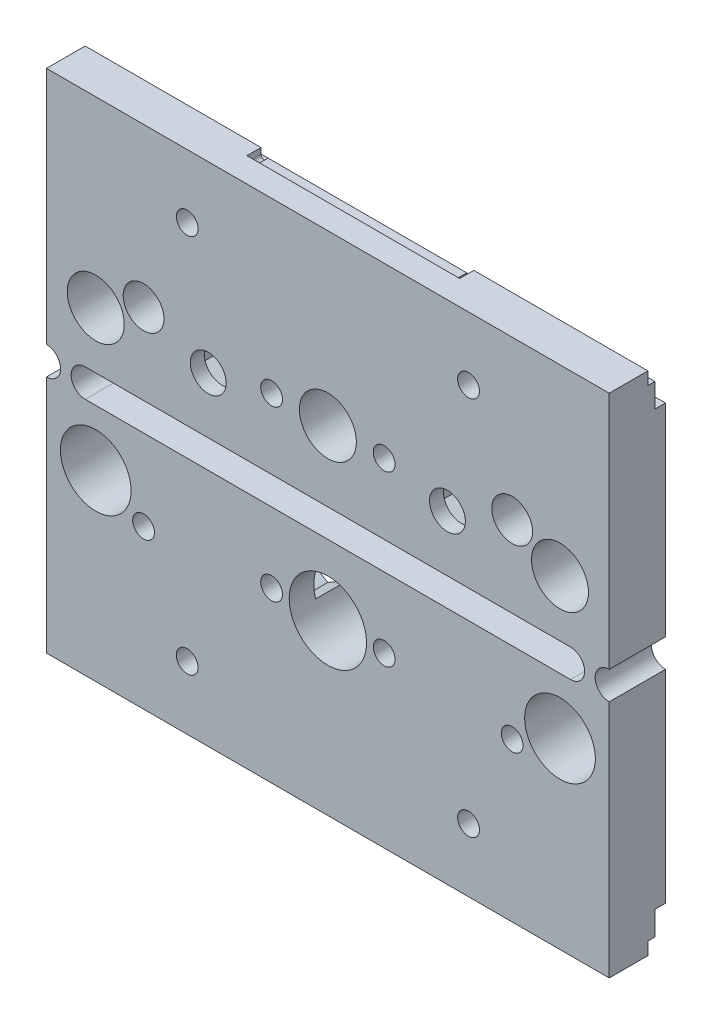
from build123d import *

# Parameters (mm, degrees)
SKETCH_2_W           = 80
SKETCH_2_H           = 34
SKETCH_2_R           = 4.05
EXTRUDE_1_DEPTH      = 8
SKETCH_3_R           = 2.55
CUT_EXTRUDE_1_DEPTH  = 88.292611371
CUT_EXTRUDE_2_DEPTH  = 88.292611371
SKETCH_5_R           = 1.55
CUT_EXTRUDE_3_DEPTH  = 88.292611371
CUT_EXTRUDE_5_DEPTH  = 4.5
SKETCH_25_R          = 1.55
CUT_EXTRUDE_13_DEPTH = 88.292611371
CUT_EXTRUDE_11_DEPTH = 2
EXTRUDE_2_DEPTH      = 8
SKETCH_26_R          = 5.025
CUT_EXTRUDE_14_DEPTH = 89.926936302
SKETCH_27_R          = 2.9
SKETCH_27_R_2        = 1.55
CUT_EXTRUDE_15_DEPTH = 89.926936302
CUT_EXTRUDE_16_DEPTH = 6
SKETCH_29_R          = 5.5
CUT_EXTRUDE_17_DEPTH = 89.926936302


with BuildPart() as part:
    # Sketch 2 → Extrude 1 (new body)
    with BuildSketch(Plane.XY):
        with Locations((40, 17)):
            Rectangle(SKETCH_2_W, SKETCH_2_H)
        with Locations((7, 8)):
            Circle(SKETCH_2_R, mode=Mode.SUBTRACT)
        with Locations((40, 10)):
            Circle(SKETCH_2_R, mode=Mode.SUBTRACT)
        with Locations((73, 8)):
            Circle(SKETCH_2_R, mode=Mode.SUBTRACT)
    extrude_1 = extrude(amount=EXTRUDE_1_DEPTH)

    # Sketch 3 → Cut-Extrude 1 (cut, through all)
    with BuildSketch(Plane.XY.offset(8)):
        with Locations((23, 8)):
            Circle(SKETCH_3_R)
        with Locations((57, 8)):
            Circle(SKETCH_3_R)
    extrude(amount=-CUT_EXTRUDE_1_DEPTH, mode=Mode.SUBTRACT)

    # Sketch 4 → Cut-Extrude 2 (cut, through all)
    with BuildSketch(Plane(origin=(80, 0, 0), x_dir=(0, 0, -1), z_dir=(1, 0, 0))):
        Polygon((-1.5, 32.2), (-2.5, 32.2), (-2.5, 34), (0, 34), (0, 28.8), (-1.5, 28.8), align=None)
    cut_extrude_2 = extrude(amount=-CUT_EXTRUDE_2_DEPTH, mode=Mode.SUBTRACT)

    # Sketch 5 → Cut-Extrude 3 (cut, through all)
    with BuildSketch(Plane.XY.offset(8)):
        with Locations((48, 10)):
            Circle(SKETCH_5_R)
        with Locations((32, 10)):
            Circle(SKETCH_5_R)
    cut_extrude_3 = extrude(amount=-CUT_EXTRUDE_3_DEPTH, mode=Mode.SUBTRACT)

    # Sketch 8 → Cut-Extrude 5 (cut)
    with BuildSketch(Plane(origin=(0, 0, 0), x_dir=(-1, 0, 0), z_dir=(0, 0, -1))):
        Polygon((-45.15, 8.354551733), (-45.15, 11.645448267), (-48, 13.290896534), (-50.85, 11.645448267), (-50.85, 8.354551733), (-48, 6.709103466), align=None)
        Polygon((-29.15, 8.354551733), (-29.15, 11.645448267), (-32, 13.290896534), (-34.85, 11.645448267), (-34.85, 8.354551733), (-32, 6.709103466), align=None)
    cut_extrude_5 = extrude(amount=-CUT_EXTRUDE_5_DEPTH, mode=Mode.SUBTRACT)

    # Sketch 25 → Cut-Extrude 13 (cut, through all)
    with BuildSketch(Plane(origin=(0, 0, 0), x_dir=(-1, 0, 0), z_dir=(0, 0, -1))):
        with Locations((-60, 25)):
            Circle(SKETCH_25_R)
        with Locations((-20, 25)):
            Circle(SKETCH_25_R)
    cut_extrude_13 = extrude(amount=-CUT_EXTRUDE_13_DEPTH, mode=Mode.SUBTRACT)

    # Sketch 19 → Cut-Extrude 11 (cut)
    with BuildSketch(Plane(origin=(0, 0, 2.5), x_dir=(-1, 0, 0), z_dir=(0, 0, -1))):
        with BuildLine():
            Line((-25, 34), (-55.247938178, 34))
            Line((-55.247938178, 34), (-55.247938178, 33.2))
            ThreePointArc((-55.247938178, 33.2), (-54.747938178, 32.7), (-54.247938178, 33.2))
            Line((-54.247938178, 33.2), (-26, 33.2))
            ThreePointArc((-26, 33.2), (-25.5, 32.7), (-25, 33.2))
            Line((-25, 33.2), (-25, 34))
        make_face()
    cut_extrude_11 = extrude(amount=-CUT_EXTRUDE_11_DEPTH, mode=Mode.SUBTRACT)

    # Sketch 22 → Extrude 2 (add)
    with BuildSketch(Plane.XY.offset(8)):
        with BuildLine():
            Line((0, -4), (5.5, -4))
            ThreePointArc((5.5, -4), (3.5, -2), (5.5, 0))
            Line((5.5, 0), (0, 0))
            ThreePointArc((0, 0), (2, -2), (0, -4))
        make_face()
        with BuildLine():
            Line((80, 0), (74.5, 0))
            ThreePointArc((74.5, 0), (76.5, -2), (74.5, -4))
            Line((74.5, -4), (80, -4))
            ThreePointArc((80, -4), (78, -2), (80, 0))
        make_face()
    extrude(amount=-EXTRUDE_2_DEPTH)

    # Mirror 2: Extrude 1, Cut-Extrude 2, Cut-Extrude 3, Cut-Extrude 5, Cut-Extrude 13, Cut-Extrude 11 across plane
    add(extrude_1.mirror(Plane(origin=(0, -2, 0), x_dir=(0, 0, 1), z_dir=(0, -1, 0))))
    add(cut_extrude_2.mirror(Plane(origin=(0, -2, 0), x_dir=(0, 0, 1), z_dir=(0, -1, 0))), mode=Mode.SUBTRACT)
    add(cut_extrude_3.mirror(Plane(origin=(0, -2, 0), x_dir=(0, 0, 1), z_dir=(0, -1, 0))), mode=Mode.SUBTRACT)
    add(cut_extrude_5.mirror(Plane(origin=(0, -2, 0), x_dir=(0, 0, 1), z_dir=(0, -1, 0))), mode=Mode.SUBTRACT)
    add(cut_extrude_13.mirror(Plane(origin=(0, -2, 0), x_dir=(0, 0, 1), z_dir=(0, -1, 0))), mode=Mode.SUBTRACT)
    add(cut_extrude_11.mirror(Plane(origin=(0, -2, 0), x_dir=(0, 0, 1), z_dir=(0, -1, 0))), mode=Mode.SUBTRACT)

    # Sketch 26 → Cut-Extrude 14 (cut, through all)
    with BuildSketch(Plane(origin=(0, 0, 0), x_dir=(-1, 0, 0), z_dir=(0, 0, -1))):
        with Locations((-73, -12)):
            Circle(SKETCH_26_R)
        with Locations((-7, -12)):
            Circle(SKETCH_26_R)
    extrude(amount=-CUT_EXTRUDE_14_DEPTH, mode=Mode.SUBTRACT)

    # Sketch 27 → Cut-Extrude 15 (cut, through all)
    with BuildSketch(Plane(origin=(0, 0, 0), x_dir=(-1, 0, 0), z_dir=(0, 0, -1))):
        with Locations((-66.2, 11.5)):
            Circle(SKETCH_27_R)
        with Locations((-66.2, -15.5)):
            Circle(SKETCH_27_R_2)
        with Locations(Location((-13.8, -15.5, 0), (0, 0, 180))):
            Circle(SKETCH_27_R_2)
        with Locations(Location((-13.8, 11.5, 0), (0, 0, 180))):
            Circle(SKETCH_27_R)
    extrude(amount=-CUT_EXTRUDE_15_DEPTH, mode=Mode.SUBTRACT)

    # Sketch 28 → Cut-Extrude 16 (cut)
    with BuildSketch(Plane(origin=(0, 0, 0), x_dir=(-1, 0, 0), z_dir=(0, 0, -1))):
        Polygon((-52.9, 5.632863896), (-52.9, 10.367136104), (-57, 12.734272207), (-61.1, 10.367136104), (-61.1, 5.632863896), (-57, 3.265727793), align=None)
        Polygon((-18.9, 5.632863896), (-18.9, 10.367136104), (-23, 12.734272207), (-27.1, 10.367136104), (-27.1, 5.632863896), (-23, 3.265727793), align=None)
    extrude(amount=-CUT_EXTRUDE_16_DEPTH, mode=Mode.SUBTRACT)

    # Sketch 29 → Cut-Extrude 17 (cut, through all)
    with BuildSketch(Plane(origin=(0, 0, 0), x_dir=(-1, 0, 0), z_dir=(0, 0, -1))):
        with Locations((-40, -14)):
            Circle(SKETCH_29_R)
    extrude(amount=-CUT_EXTRUDE_17_DEPTH, mode=Mode.SUBTRACT)


solid = part.part
